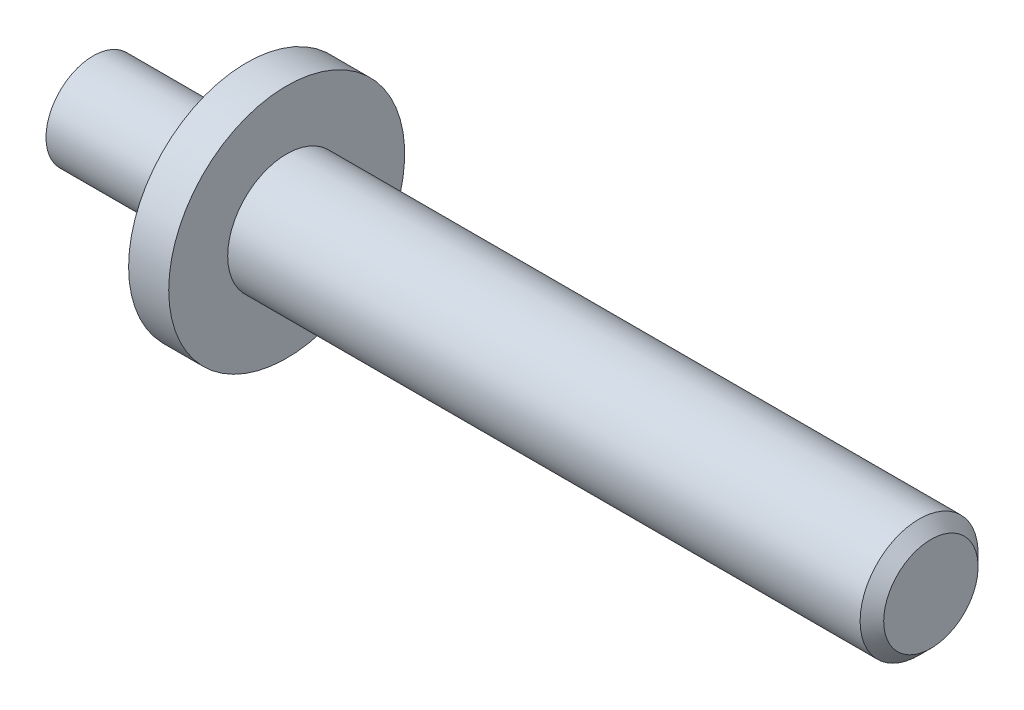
from build123d import *

# Parameters (mm, degrees)
CONG_1_R        = 2
CHANFREIN1_SIZE = 1


with BuildPart() as part:
    # Esquisse1 → R_volution1 (revolve)
    with BuildSketch(Plane.XY, mode=Mode.PRIVATE) as r_volution1_sk:
        Polygon((0, 0), (71, 0), (71, 5), (16.4, 5), (16.4, 10), (13, 10), (13, 4), (0, 4), align=None)
    revolve(r_volution1_sk.sketch.rotate(Axis((0, 0, 0), (1, 0, 0)), 90), axis=Axis((0, 0, 0), (1, 0, 0)))

    # Cong_1
    cong_1_edges = [part.edges().sort_by_distance(p)[0] for p in [
        (13, 0, -4),
    ]]
    fillet(cong_1_edges, radius=CONG_1_R)

    # Chanfrein1
    chanfrein1_edges = [part.edges().sort_by_distance(p)[0] for p in [
        (71, 0, -5),
    ]]
    chamfer(chanfrein1_edges, length=CHANFREIN1_SIZE)


solid = part.part
